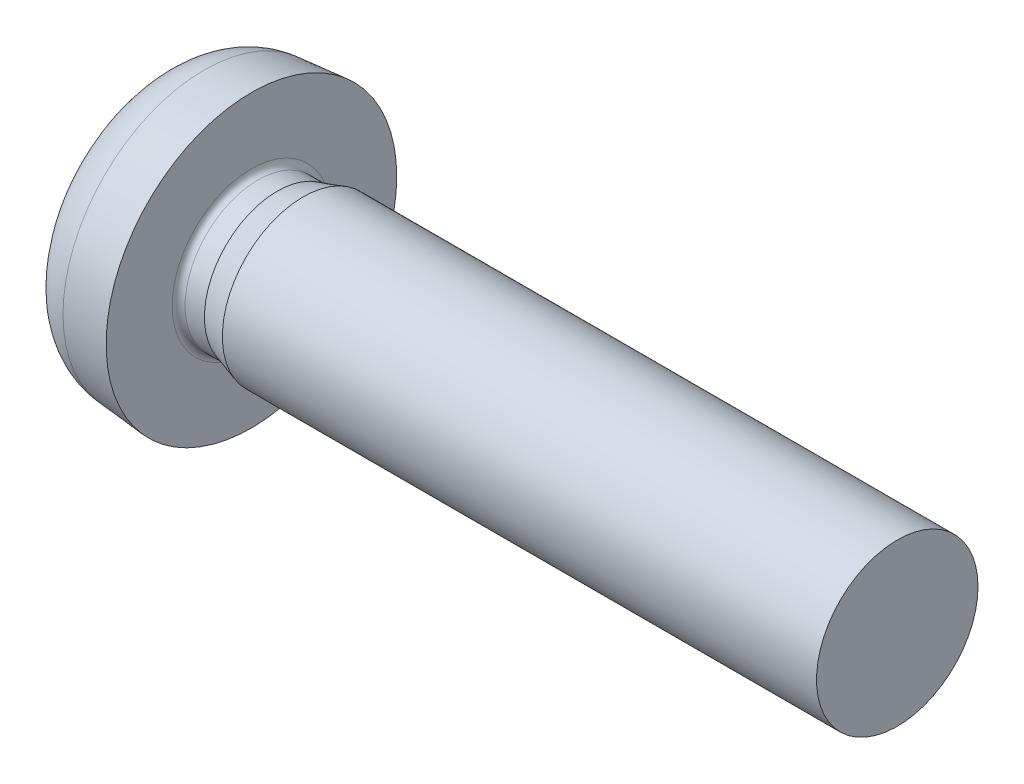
ISO-10303-21;
HEADER;
FILE_DESCRIPTION(('STEP AP214'),'2;1');
FILE_NAME('part.step','',(''),(''),'','','');
FILE_SCHEMA(('AUTOMOTIVE_DESIGN { 1 0 10303 214 1 1 1 1 }'));
ENDSEC;
DATA;
#1=APPLICATION_CONTEXT('core data for automotive mechanical design processes');
#2=APPLICATION_PROTOCOL_DEFINITION('international standard','automotive_design',2000,#1);
#3=PRODUCT_CONTEXT('',#1,'mechanical');
#4=PRODUCT('Part','Part','',(#3));
#5=PRODUCT_RELATED_PRODUCT_CATEGORY('part','',(#4));
#6=PRODUCT_DEFINITION_FORMATION('','',#4);
#7=PRODUCT_DEFINITION_CONTEXT('part definition',#1,'design');
#8=PRODUCT_DEFINITION('design','',#6,#7);
#9=PRODUCT_DEFINITION_SHAPE('','',#8);
#10=(LENGTH_UNIT() NAMED_UNIT(*) SI_UNIT(.MILLI.,.METRE.));
#11=(NAMED_UNIT(*) PLANE_ANGLE_UNIT() SI_UNIT($,.RADIAN.));
#12=(NAMED_UNIT(*) SI_UNIT($,.STERADIAN.) SOLID_ANGLE_UNIT());
#13=UNCERTAINTY_MEASURE_WITH_UNIT(LENGTH_MEASURE(1.E-05),#10,'distance_accuracy_value','');
#14=(GEOMETRIC_REPRESENTATION_CONTEXT(3) GLOBAL_UNCERTAINTY_ASSIGNED_CONTEXT((#13)) GLOBAL_UNIT_ASSIGNED_CONTEXT((#10,
#11,#12)) REPRESENTATION_CONTEXT('',''));
#15=CARTESIAN_POINT('',(0.,0.,0.));
#16=DIRECTION('',(0.,0.,1.));
#17=DIRECTION('',(1.,0.,0.));
#18=AXIS2_PLACEMENT_3D('',#15,#16,#17);
#19=CARTESIAN_POINT('',(8.70000000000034,0.,0.));
#20=DIRECTION('',(1.,0.,0.));
#21=DIRECTION('',(0.,1.,0.));
#22=AXIS2_PLACEMENT_3D('',#19,#20,#21);
#23=SPHERICAL_SURFACE('',#22,12.0000000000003);
#24=CARTESIAN_POINT('',(8.70000000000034,0.,-0.600000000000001));
#25=DIRECTION('',(0.,0.,1.));
#26=DIRECTION('',(1.,0.,0.));
#27=AXIS2_PLACEMENT_3D('',#24,#25,#26);
#28=CIRCLE('',#27,11.9849906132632);
#29=CARTESIAN_POINT('',(-3.19075270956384,1.5,-0.600000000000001));
#30=VERTEX_POINT('',#29);
#31=CARTESIAN_POINT('',(-3.03190095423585,2.45,-0.600000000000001));
#32=VERTEX_POINT('',#31);
#33=EDGE_CURVE('E223',#30,#32,#28,.F.);
#34=ORIENTED_EDGE('',*,*,#33,.T.);
#35=CARTESIAN_POINT('',(8.70000000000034,2.45,0.));
#36=DIRECTION('',(0.,-1.,0.));
#37=DIRECTION('',(0.,0.,-1.));
#38=AXIS2_PLACEMENT_3D('',#35,#36,#37);
#39=CIRCLE('',#38,11.7472337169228);
#40=CARTESIAN_POINT('',(-3.03190095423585,2.45,0.600000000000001));
#41=VERTEX_POINT('',#40);
#42=EDGE_CURVE('E360',#32,#41,#39,.F.);
#43=ORIENTED_EDGE('',*,*,#42,.T.);
#44=CARTESIAN_POINT('',(8.70000000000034,0.,0.600000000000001));
#45=DIRECTION('',(0.,0.,-1.));
#46=DIRECTION('',(-1.,0.,0.));
#47=AXIS2_PLACEMENT_3D('',#44,#45,#46);
#48=CIRCLE('',#47,11.9849906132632);
#49=CARTESIAN_POINT('',(-3.19075270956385,1.5,0.600000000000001));
#50=VERTEX_POINT('',#49);
#51=EDGE_CURVE('E185',#41,#50,#48,.F.);
#52=ORIENTED_EDGE('',*,*,#51,.T.);
#53=CARTESIAN_POINT('',(-3.19072747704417,0.600000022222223,1.5002));
#54=CARTESIAN_POINT('',(-3.19704855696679,0.599944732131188,1.45014663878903));
#55=CARTESIAN_POINT('',(-3.2028355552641,0.604151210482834,1.40002617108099));
#56=CARTESIAN_POINT('',(-3.21319825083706,0.620839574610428,1.30107200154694));
#57=CARTESIAN_POINT('',(-3.21777437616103,0.633318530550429,1.25223785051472));
#58=CARTESIAN_POINT('',(-3.22558007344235,0.666317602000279,1.15720078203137));
#59=CARTESIAN_POINT('',(-3.22880853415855,0.686844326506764,1.11100006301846));
#60=CARTESIAN_POINT('',(-3.2338172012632,0.735367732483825,1.02263672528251));
#61=CARTESIAN_POINT('',(-3.23559790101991,0.763361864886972,0.980472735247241));
#62=CARTESIAN_POINT('',(-3.23764946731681,0.825769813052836,0.901738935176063));
#63=CARTESIAN_POINT('',(-3.23793296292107,0.860127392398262,0.86512487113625));
#64=CARTESIAN_POINT('',(-3.23701554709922,0.934440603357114,0.798112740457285));
#65=CARTESIAN_POINT('',(-3.23581442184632,0.974397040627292,0.767715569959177));
#66=CARTESIAN_POINT('',(-3.23197125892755,1.05858769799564,0.714100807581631));
#67=CARTESIAN_POINT('',(-3.22933461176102,1.10280540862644,0.690856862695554));
#68=CARTESIAN_POINT('',(-3.22270116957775,1.19438163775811,0.652020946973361));
#69=CARTESIAN_POINT('',(-3.21870483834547,1.24173908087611,0.636426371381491));
#70=CARTESIAN_POINT('',(-3.21079050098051,1.32445339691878,0.616573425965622));
#71=CARTESIAN_POINT('',(-3.20717502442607,1.3593821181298,0.61035062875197));
#72=CARTESIAN_POINT('',(-3.19936940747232,1.42961484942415,0.602059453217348));
#73=CARTESIAN_POINT('',(-3.19518009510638,1.46491825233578,0.599985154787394));
#74=CARTESIAN_POINT('',(-3.19072747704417,1.5002,0.600000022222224));
#75=B_SPLINE_CURVE_WITH_KNOTS('',3,(#53,#54,#55,#56,#57,#58,#59,#60,#61,#62,#63,#64,#65,#66,#67,
#68,#69,#70,#71,#72,#73,#74),.UNSPECIFIED.,.F.,.F.,(4,2,2,2,2,2,2,2,2,2,4),(0.,
0.151172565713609,0.302291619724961,0.45353503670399,0.604726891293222,0.754641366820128,
0.904577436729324,1.05395432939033,1.20328032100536,1.3100314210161,1.41663007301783),.UNSPECIFIED.);
#76=CARTESIAN_POINT('',(-3.19075270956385,0.6,1.5));
#77=VERTEX_POINT('',#76);
#78=EDGE_CURVE('E178',#77,#50,#75,.T.);
#79=ORIENTED_EDGE('',*,*,#78,.F.);
#80=CARTESIAN_POINT('',(8.70000000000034,0.6,0.));
#81=DIRECTION('',(0.,-1.,0.));
#82=DIRECTION('',(0.,0.,-1.));
#83=AXIS2_PLACEMENT_3D('',#80,#81,#82);
#84=CIRCLE('',#83,11.9849906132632);
#85=CARTESIAN_POINT('',(-3.03190095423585,0.6,2.45));
#86=VERTEX_POINT('',#85);
#87=EDGE_CURVE('E175',#77,#86,#84,.F.);
#88=ORIENTED_EDGE('',*,*,#87,.T.);
#89=CARTESIAN_POINT('',(8.70000000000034,0.,2.45));
#90=DIRECTION('',(0.,0.,-1.));
#91=DIRECTION('',(-1.,0.,0.));
#92=AXIS2_PLACEMENT_3D('',#89,#90,#91);
#93=CIRCLE('',#92,11.7472337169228);
#94=CARTESIAN_POINT('',(-3.03190095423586,-0.6,2.45));
#95=VERTEX_POINT('',#94);
#96=EDGE_CURVE('E10',#86,#95,#93,.F.);
#97=ORIENTED_EDGE('',*,*,#96,.T.);
#98=CARTESIAN_POINT('',(8.70000000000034,-0.6,0.));
#99=DIRECTION('',(0.,1.,0.));
#100=DIRECTION('',(0.,0.,1.));
#101=AXIS2_PLACEMENT_3D('',#98,#99,#100);
#102=CIRCLE('',#101,11.9849906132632);
#103=CARTESIAN_POINT('',(-3.19075270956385,-0.6,1.5));
#104=VERTEX_POINT('',#103);
#105=EDGE_CURVE('E24',#95,#104,#102,.F.);
#106=ORIENTED_EDGE('',*,*,#105,.T.);
#107=CARTESIAN_POINT('',(-3.19072747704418,-1.5002,0.600000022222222));
#108=CARTESIAN_POINT('',(-3.1970485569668,-1.45014663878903,0.599944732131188));
#109=CARTESIAN_POINT('',(-3.20283555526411,-1.40002617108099,0.604151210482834));
#110=CARTESIAN_POINT('',(-3.21319825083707,-1.30107200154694,0.620839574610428));
#111=CARTESIAN_POINT('',(-3.21777437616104,-1.25223785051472,0.633318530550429));
#112=CARTESIAN_POINT('',(-3.22558007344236,-1.15720078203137,0.666317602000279));
#113=CARTESIAN_POINT('',(-3.22880853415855,-1.11100006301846,0.686844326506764));
#114=CARTESIAN_POINT('',(-3.2338172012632,-1.02263672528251,0.735367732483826));
#115=CARTESIAN_POINT('',(-3.23559790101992,-0.980472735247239,0.763361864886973));
#116=CARTESIAN_POINT('',(-3.23764946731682,-0.901738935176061,0.825769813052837));
#117=CARTESIAN_POINT('',(-3.23793296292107,-0.865124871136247,0.860127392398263));
#118=CARTESIAN_POINT('',(-3.23701554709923,-0.798112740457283,0.934440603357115));
#119=CARTESIAN_POINT('',(-3.23581442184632,-0.767715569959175,0.974397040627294));
#120=CARTESIAN_POINT('',(-3.23197125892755,-0.714100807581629,1.05858769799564));
#121=CARTESIAN_POINT('',(-3.22933461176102,-0.690856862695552,1.10280540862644));
#122=CARTESIAN_POINT('',(-3.22270116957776,-0.652020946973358,1.19438163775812));
#123=CARTESIAN_POINT('',(-3.21870483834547,-0.636426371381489,1.24173908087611));
#124=CARTESIAN_POINT('',(-3.21079050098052,-0.616573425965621,1.32445339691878));
#125=CARTESIAN_POINT('',(-3.20717502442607,-0.610350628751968,1.3593821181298));
#126=CARTESIAN_POINT('',(-3.19936940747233,-0.602059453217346,1.42961484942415));
#127=CARTESIAN_POINT('',(-3.19518009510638,-0.599985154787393,1.46491825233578));
#128=CARTESIAN_POINT('',(-3.19072747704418,-0.600000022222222,1.5002));
#129=B_SPLINE_CURVE_WITH_KNOTS('',3,(#107,#108,#109,#110,#111,#112,#113,#114,#115,#116,#117,
#118,#119,#120,#121,#122,#123,#124,#125,#126,#127,#128),.UNSPECIFIED.,.F.,.F.,(4,2,2,2,2,2,2,2,
2,2,4),(0.,0.151172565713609,0.302291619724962,0.453535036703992,0.604726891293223,
0.75464136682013,0.904577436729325,1.05395432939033,1.20328032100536,1.31003142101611,
1.41663007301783),.UNSPECIFIED.);
#130=CARTESIAN_POINT('',(-3.19075270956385,-1.5,0.6));
#131=VERTEX_POINT('',#130);
#132=EDGE_CURVE('E267',#131,#104,#129,.T.);
#133=ORIENTED_EDGE('',*,*,#132,.F.);
#134=CARTESIAN_POINT('',(8.70000000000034,0.,0.6));
#135=DIRECTION('',(0.,0.,-1.));
#136=DIRECTION('',(0.,1.,0.));
#137=AXIS2_PLACEMENT_3D('',#134,#135,#136);
#138=CIRCLE('',#137,11.9849906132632);
#139=CARTESIAN_POINT('',(-3.03190095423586,-2.45,0.6));
#140=VERTEX_POINT('',#139);
#141=EDGE_CURVE('E273',#131,#140,#138,.F.);
#142=ORIENTED_EDGE('',*,*,#141,.T.);
#143=CARTESIAN_POINT('',(8.70000000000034,-2.45,0.));
#144=DIRECTION('',(0.,1.,0.));
#145=DIRECTION('',(0.,0.,1.));
#146=AXIS2_PLACEMENT_3D('',#143,#144,#145);
#147=CIRCLE('',#146,11.7472337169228);
#148=CARTESIAN_POINT('',(-3.03190095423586,-2.45,-0.600000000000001));
#149=VERTEX_POINT('',#148);
#150=EDGE_CURVE('E379',#140,#149,#147,.F.);
#151=ORIENTED_EDGE('',*,*,#150,.T.);
#152=CARTESIAN_POINT('',(8.70000000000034,0.,-0.600000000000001));
#153=DIRECTION('',(0.,0.,1.));
#154=DIRECTION('',(1.,0.,0.));
#155=AXIS2_PLACEMENT_3D('',#152,#153,#154);
#156=CIRCLE('',#155,11.9849906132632);
#157=CARTESIAN_POINT('',(-3.19075270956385,-1.5,-0.600000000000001));
#158=VERTEX_POINT('',#157);
#159=EDGE_CURVE('E239',#149,#158,#156,.F.);
#160=ORIENTED_EDGE('',*,*,#159,.T.);
#161=CARTESIAN_POINT('',(-3.19072747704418,-0.600000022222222,-1.5002));
#162=CARTESIAN_POINT('',(-3.19704855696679,-0.599944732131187,-1.45014663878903));
#163=CARTESIAN_POINT('',(-3.20283555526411,-0.604151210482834,-1.40002617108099));
#164=CARTESIAN_POINT('',(-3.21319825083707,-0.620839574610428,-1.30107200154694));
#165=CARTESIAN_POINT('',(-3.21777437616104,-0.633318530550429,-1.25223785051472));
#166=CARTESIAN_POINT('',(-3.22558007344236,-0.666317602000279,-1.15720078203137));
#167=CARTESIAN_POINT('',(-3.22880853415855,-0.686844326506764,-1.11100006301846));
#168=CARTESIAN_POINT('',(-3.2338172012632,-0.735367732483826,-1.02263672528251));
#169=CARTESIAN_POINT('',(-3.23559790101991,-0.763361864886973,-0.98047273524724));
#170=CARTESIAN_POINT('',(-3.23764946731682,-0.825769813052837,-0.901738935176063));
#171=CARTESIAN_POINT('',(-3.23793296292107,-0.860127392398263,-0.865124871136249));
#172=CARTESIAN_POINT('',(-3.23701554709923,-0.934440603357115,-0.798112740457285));
#173=CARTESIAN_POINT('',(-3.23581442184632,-0.974397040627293,-0.767715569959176));
#174=CARTESIAN_POINT('',(-3.23197125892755,-1.05858769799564,-0.714100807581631));
#175=CARTESIAN_POINT('',(-3.22933461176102,-1.10280540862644,-0.690856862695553));
#176=CARTESIAN_POINT('',(-3.22270116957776,-1.19438163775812,-0.65202094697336));
#177=CARTESIAN_POINT('',(-3.21870483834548,-1.24173908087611,-0.63642637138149));
#178=CARTESIAN_POINT('',(-3.21079050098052,-1.32445339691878,-0.616573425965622));
#179=CARTESIAN_POINT('',(-3.20717502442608,-1.3593821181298,-0.61035062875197));
#180=CARTESIAN_POINT('',(-3.19936940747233,-1.42961484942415,-0.602059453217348));
#181=CARTESIAN_POINT('',(-3.19518009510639,-1.46491825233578,-0.599985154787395));
#182=CARTESIAN_POINT('',(-3.19072747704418,-1.5002,-0.600000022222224));
#183=B_SPLINE_CURVE_WITH_KNOTS('',3,(#161,#162,#163,#164,#165,#166,#167,#168,#169,#170,#171,
#172,#173,#174,#175,#176,#177,#178,#179,#180,#181,#182),.UNSPECIFIED.,.F.,.F.,(4,2,2,2,2,2,2,2,
2,2,4),(0.,0.151172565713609,0.302291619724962,0.453535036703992,0.604726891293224,
0.75464136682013,0.904577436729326,1.05395432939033,1.20328032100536,1.31003142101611,
1.41663007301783),.UNSPECIFIED.);
#184=CARTESIAN_POINT('',(-3.19075270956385,-0.6,-1.5));
#185=VERTEX_POINT('',#184);
#186=EDGE_CURVE('E232',#185,#158,#183,.T.);
#187=ORIENTED_EDGE('',*,*,#186,.F.);
#188=CARTESIAN_POINT('',(8.70000000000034,-0.6,0.));
#189=DIRECTION('',(0.,1.,0.));
#190=DIRECTION('',(0.,0.,1.));
#191=AXIS2_PLACEMENT_3D('',#188,#189,#190);
#192=CIRCLE('',#191,11.9849906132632);
#193=CARTESIAN_POINT('',(-3.03190095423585,-0.6,-2.45));
#194=VERTEX_POINT('',#193);
#195=EDGE_CURVE('E229',#185,#194,#192,.F.);
#196=ORIENTED_EDGE('',*,*,#195,.T.);
#197=CARTESIAN_POINT('',(8.70000000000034,0.,-2.45));
#198=DIRECTION('',(0.,0.,1.));
#199=DIRECTION('',(1.,0.,0.));
#200=AXIS2_PLACEMENT_3D('',#197,#198,#199);
#201=CIRCLE('',#200,11.7472337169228);
#202=CARTESIAN_POINT('',(-3.03190095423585,0.6,-2.45));
#203=VERTEX_POINT('',#202);
#204=EDGE_CURVE('E226',#194,#203,#201,.F.);
#205=ORIENTED_EDGE('',*,*,#204,.T.);
#206=CARTESIAN_POINT('',(8.70000000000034,0.6,0.));
#207=DIRECTION('',(0.,-1.,0.));
#208=DIRECTION('',(0.,0.,-1.));
#209=AXIS2_PLACEMENT_3D('',#206,#207,#208);
#210=CIRCLE('',#209,11.9849906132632);
#211=CARTESIAN_POINT('',(-3.19075270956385,0.6,-1.5));
#212=VERTEX_POINT('',#211);
#213=EDGE_CURVE('E222',#203,#212,#210,.F.);
#214=ORIENTED_EDGE('',*,*,#213,.T.);
#215=CARTESIAN_POINT('',(-3.19072747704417,1.5002,-0.600000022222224));
#216=CARTESIAN_POINT('',(-3.19704855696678,1.45014663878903,-0.599944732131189));
#217=CARTESIAN_POINT('',(-3.2028355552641,1.40002617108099,-0.604151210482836));
#218=CARTESIAN_POINT('',(-3.21319825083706,1.30107200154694,-0.620839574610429));
#219=CARTESIAN_POINT('',(-3.21777437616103,1.25223785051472,-0.633318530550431));
#220=CARTESIAN_POINT('',(-3.22558007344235,1.15720078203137,-0.66631760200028));
#221=CARTESIAN_POINT('',(-3.22880853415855,1.11100006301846,-0.686844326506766));
#222=CARTESIAN_POINT('',(-3.23381720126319,1.02263672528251,-0.735367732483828));
#223=CARTESIAN_POINT('',(-3.23559790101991,0.980472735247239,-0.763361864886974));
#224=CARTESIAN_POINT('',(-3.23764946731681,0.901738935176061,-0.825769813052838));
#225=CARTESIAN_POINT('',(-3.23793296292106,0.865124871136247,-0.860127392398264));
#226=CARTESIAN_POINT('',(-3.23701554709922,0.798112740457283,-0.934440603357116));
#227=CARTESIAN_POINT('',(-3.23581442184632,0.767715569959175,-0.974397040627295));
#228=CARTESIAN_POINT('',(-3.23197125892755,0.714100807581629,-1.05858769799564));
#229=CARTESIAN_POINT('',(-3.22933461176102,0.690856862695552,-1.10280540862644));
#230=CARTESIAN_POINT('',(-3.22270116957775,0.652020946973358,-1.19438163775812));
#231=CARTESIAN_POINT('',(-3.21870483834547,0.636426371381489,-1.24173908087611));
#232=CARTESIAN_POINT('',(-3.21079050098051,0.616573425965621,-1.32445339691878));
#233=CARTESIAN_POINT('',(-3.20717502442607,0.610350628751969,-1.35938211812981));
#234=CARTESIAN_POINT('',(-3.19936940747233,0.602059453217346,-1.42961484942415));
#235=CARTESIAN_POINT('',(-3.19518009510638,0.599985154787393,-1.46491825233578));
#236=CARTESIAN_POINT('',(-3.19072747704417,0.600000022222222,-1.5002));
#237=B_SPLINE_CURVE_WITH_KNOTS('',3,(#215,#216,#217,#218,#219,#220,#221,#222,#223,#224,#225,
#226,#227,#228,#229,#230,#231,#232,#233,#234,#235,#236),.UNSPECIFIED.,.F.,.F.,(4,2,2,2,2,2,2,2,
2,2,4),(0.,0.151172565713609,0.302291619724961,0.453535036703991,0.604726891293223,
0.75464136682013,0.904577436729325,1.05395432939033,1.20328032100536,1.3100314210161,
1.41663007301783),.UNSPECIFIED.);
#238=EDGE_CURVE('E215',#30,#212,#237,.T.);
#239=ORIENTED_EDGE('',*,*,#238,.F.);
#240=EDGE_LOOP('',(#34,#43,#52,#79,#88,#97,#106,#133,#142,#151,#160,#187,#196,#205,#214,#239));
#241=FACE_BOUND('',#240,.T.);
#242=CARTESIAN_POINT('',(-2.86390297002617,0.,0.));
#243=DIRECTION('',(1.,0.,0.));
#244=DIRECTION('',(0.,0.,-1.));
#245=AXIS2_PLACEMENT_3D('',#242,#243,#244);
#246=CIRCLE('',#245,3.2056431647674);
#247=CARTESIAN_POINT('',(-2.86390297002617,0.,-3.2056431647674));
#248=VERTEX_POINT('',#247);
#249=EDGE_CURVE('E172',#248,#248,#246,.T.);
#250=ORIENTED_EDGE('',*,*,#249,.F.);
#251=EDGE_LOOP('',(#250));
#252=FACE_BOUND('',#251,.T.);
#253=ADVANCED_FACE('F16',(#241,#252),#23,.T.);
#254=CARTESIAN_POINT('',(-1.32204927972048,0.,0.));
#255=DIRECTION('',(1.,0.,0.));
#256=DIRECTION('',(0.,0.,-1.));
#257=AXIS2_PLACEMENT_3D('',#254,#255,#256);
#258=TOROIDAL_SURFACE('',#257,2.77822393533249,1.6);
#259=ORIENTED_EDGE('',*,*,#249,.T.);
#260=EDGE_LOOP('',(#259));
#261=FACE_BOUND('',#260,.T.);
#262=CARTESIAN_POINT('',(-1.46149846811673,0.,0.));
#263=DIRECTION('',(1.,0.,0.));
#264=DIRECTION('',(0.,0.,-1.));
#265=AXIS2_PLACEMENT_3D('',#262,#263,#264);
#266=CIRCLE('',#265,4.37213545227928);
#267=CARTESIAN_POINT('',(-1.46149846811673,0.,-4.37213545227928));
#268=VERTEX_POINT('',#267);
#269=EDGE_CURVE('E169',#268,#268,#266,.T.);
#270=ORIENTED_EDGE('',*,*,#269,.F.);
#271=EDGE_LOOP('',(#270));
#272=FACE_BOUND('',#271,.T.);
#273=ADVANCED_FACE('F386',(#261,#272),#258,.T.);
#274=CARTESIAN_POINT('',(-1.46149846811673,0.,0.));
#275=DIRECTION('',(1.,0.,0.));
#276=DIRECTION('',(0.,0.,-1.));
#277=AXIS2_PLACEMENT_3D('',#274,#275,#276);
#278=CONICAL_SURFACE('',#277,4.37213545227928,0.0872664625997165);
#279=CARTESIAN_POINT('',(0.,0.,0.));
#280=DIRECTION('',(1.,0.,0.));
#281=DIRECTION('',(0.,0.,-1.));
#282=AXIS2_PLACEMENT_3D('',#279,#280,#281);
#283=CIRCLE('',#282,4.5);
#284=CARTESIAN_POINT('',(0.,0.,-4.5));
#285=VERTEX_POINT('',#284);
#286=EDGE_CURVE('E166',#285,#285,#283,.T.);
#287=ORIENTED_EDGE('',*,*,#286,.F.);
#288=EDGE_LOOP('',(#287));
#289=FACE_BOUND('',#288,.T.);
#290=ORIENTED_EDGE('',*,*,#269,.T.);
#291=EDGE_LOOP('',(#290));
#292=FACE_BOUND('',#291,.T.);
#293=ADVANCED_FACE('F390',(#289,#292),#278,.T.);
#294=CARTESIAN_POINT('',(0.,4.5,0.));
#295=DIRECTION('',(-1.,0.,0.));
#296=DIRECTION('',(0.,0.,1.));
#297=AXIS2_PLACEMENT_3D('',#294,#295,#296);
#298=PLANE('',#297);
#299=CARTESIAN_POINT('',(0.,0.,0.));
#300=DIRECTION('',(1.,0.,0.));
#301=DIRECTION('',(0.,0.,-1.));
#302=AXIS2_PLACEMENT_3D('',#299,#300,#301);
#303=CIRCLE('',#302,2.45474999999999);
#304=CARTESIAN_POINT('',(0.,0.,-2.45474999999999));
#305=VERTEX_POINT('',#304);
#306=EDGE_CURVE('E163',#305,#305,#303,.T.);
#307=ORIENTED_EDGE('',*,*,#306,.F.);
#308=EDGE_LOOP('',(#307));
#309=FACE_BOUND('',#308,.T.);
#310=ORIENTED_EDGE('',*,*,#286,.T.);
#311=EDGE_LOOP('',(#310));
#312=FACE_BOUND('',#311,.T.);
#313=ADVANCED_FACE('F395',(#309,#312),#298,.F.);
#314=CARTESIAN_POINT('',(0.2,0.,0.));
#315=DIRECTION('',(1.,0.,0.));
#316=DIRECTION('',(0.,0.,-1.));
#317=AXIS2_PLACEMENT_3D('',#314,#315,#316);
#318=TOROIDAL_SURFACE('',#317,2.45474999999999,0.2);
#319=CARTESIAN_POINT('',(0.200000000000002,0.,0.));
#320=DIRECTION('',(1.,0.,0.));
#321=DIRECTION('',(0.,0.,-1.));
#322=AXIS2_PLACEMENT_3D('',#319,#320,#321);
#323=CIRCLE('',#322,2.25474999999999);
#324=CARTESIAN_POINT('',(0.200000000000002,0.,-2.25474999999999));
#325=VERTEX_POINT('',#324);
#326=EDGE_CURVE('E160',#325,#325,#323,.T.);
#327=ORIENTED_EDGE('',*,*,#326,.F.);
#328=EDGE_LOOP('',(#327));
#329=FACE_BOUND('',#328,.T.);
#330=ORIENTED_EDGE('',*,*,#306,.T.);
#331=EDGE_LOOP('',(#330));
#332=FACE_BOUND('',#331,.T.);
#333=ADVANCED_FACE('F402',(#329,#332),#318,.F.);
#334=CARTESIAN_POINT('',(20.,0.,0.));
#335=DIRECTION('',(1.,0.,0.));
#336=DIRECTION('',(0.,0.,-1.));
#337=AXIS2_PLACEMENT_3D('',#334,#335,#336);
#338=CYLINDRICAL_SURFACE('',#337,2.25474999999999);
#339=CARTESIAN_POINT('',(0.799999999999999,0.,0.));
#340=DIRECTION('',(1.,0.,0.));
#341=DIRECTION('',(0.,0.,-1.));
#342=AXIS2_PLACEMENT_3D('',#339,#340,#341);
#343=CIRCLE('',#342,2.25474999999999);
#344=CARTESIAN_POINT('',(0.799999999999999,0.,-2.25474999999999));
#345=VERTEX_POINT('',#344);
#346=EDGE_CURVE('E157',#345,#345,#343,.T.);
#347=ORIENTED_EDGE('',*,*,#346,.F.);
#348=EDGE_LOOP('',(#347));
#349=FACE_BOUND('',#348,.T.);
#350=ORIENTED_EDGE('',*,*,#326,.T.);
#351=EDGE_LOOP('',(#350));
#352=FACE_BOUND('',#351,.T.);
#353=ADVANCED_FACE('F406',(#349,#352),#338,.T.);
#354=CARTESIAN_POINT('',(0.799999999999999,0.,0.));
#355=DIRECTION('',(1.,0.,0.));
#356=DIRECTION('',(0.,0.,-1.));
#357=AXIS2_PLACEMENT_3D('',#354,#355,#356);
#358=CONICAL_SURFACE('',#357,2.25474999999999,0.29746650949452);
#359=CARTESIAN_POINT('',(1.6,0.,0.));
#360=DIRECTION('',(1.,0.,0.));
#361=DIRECTION('',(0.,0.,-1.));
#362=AXIS2_PLACEMENT_3D('',#359,#360,#361);
#363=CIRCLE('',#362,2.5);
#364=CARTESIAN_POINT('',(1.6,0.,-2.5));
#365=VERTEX_POINT('',#364);
#366=EDGE_CURVE('E149',#365,#365,#363,.T.);
#367=ORIENTED_EDGE('',*,*,#366,.F.);
#368=EDGE_LOOP('',(#367));
#369=FACE_BOUND('',#368,.T.);
#370=ORIENTED_EDGE('',*,*,#346,.T.);
#371=EDGE_LOOP('',(#370));
#372=FACE_BOUND('',#371,.T.);
#373=ADVANCED_FACE('F410',(#369,#372),#358,.T.);
#374=CARTESIAN_POINT('',(20.,0.,0.));
#375=DIRECTION('',(1.,0.,0.));
#376=DIRECTION('',(0.,0.,-1.));
#377=AXIS2_PLACEMENT_3D('',#374,#375,#376);
#378=CYLINDRICAL_SURFACE('',#377,2.5);
#379=CARTESIAN_POINT('',(20.,0.,0.));
#380=DIRECTION('',(1.,0.,0.));
#381=DIRECTION('',(0.,0.,-1.));
#382=AXIS2_PLACEMENT_3D('',#379,#380,#381);
#383=CIRCLE('',#382,2.5);
#384=CARTESIAN_POINT('',(20.,0.,-2.5));
#385=VERTEX_POINT('',#384);
#386=EDGE_CURVE('E145',#385,#385,#383,.T.);
#387=ORIENTED_EDGE('',*,*,#386,.F.);
#388=EDGE_LOOP('',(#387));
#389=FACE_BOUND('',#388,.T.);
#390=ORIENTED_EDGE('',*,*,#366,.T.);
#391=EDGE_LOOP('',(#390));
#392=FACE_BOUND('',#391,.T.);
#393=ADVANCED_FACE('F414',(#389,#392),#378,.T.);
#394=CARTESIAN_POINT('',(20.,2.5,0.));
#395=DIRECTION('',(-1.,0.,0.));
#396=DIRECTION('',(0.,0.,1.));
#397=AXIS2_PLACEMENT_3D('',#394,#395,#396);
#398=PLANE('',#397);
#399=ORIENTED_EDGE('',*,*,#386,.T.);
#400=EDGE_LOOP('',(#399));
#401=FACE_BOUND('',#400,.T.);
#402=ADVANCED_FACE('F418',(#401),#398,.F.);
#403=CARTESIAN_POINT('',(-1.65,0.6,2.45));
#404=DIRECTION('',(0.,0.,-1.));
#405=DIRECTION('',(-1.,0.,0.));
#406=AXIS2_PLACEMENT_3D('',#403,#404,#405);
#407=PLANE('',#406);
#408=DIRECTION('',(-1.,0.,0.));
#409=VECTOR('',#408,1.);
#410=CARTESIAN_POINT('',(-1.65,0.6,2.45));
#411=LINE('',#410,#409);
#412=CARTESIAN_POINT('',(-1.65,0.6,2.45));
#413=VERTEX_POINT('',#412);
#414=EDGE_CURVE('E31',#413,#86,#411,.T.);
#415=ORIENTED_EDGE('',*,*,#414,.F.);
#416=DIRECTION('',(0.,-1.,0.));
#417=VECTOR('',#416,1.);
#418=CARTESIAN_POINT('',(-1.65,0.6,2.45));
#419=LINE('',#418,#417);
#420=CARTESIAN_POINT('',(-1.65,-0.6,2.45));
#421=VERTEX_POINT('',#420);
#422=EDGE_CURVE('E134',#413,#421,#419,.T.);
#423=ORIENTED_EDGE('',*,*,#422,.T.);
#424=DIRECTION('',(-1.,0.,0.));
#425=VECTOR('',#424,1.);
#426=CARTESIAN_POINT('',(-1.65,-0.6,2.45));
#427=LINE('',#426,#425);
#428=EDGE_CURVE('E142',#421,#95,#427,.T.);
#429=ORIENTED_EDGE('',*,*,#428,.T.);
#430=ORIENTED_EDGE('',*,*,#96,.F.);
#431=EDGE_LOOP('',(#415,#423,#429,#430));
#432=FACE_BOUND('',#431,.T.);
#433=ADVANCED_FACE('F141',(#432),#407,.T.);
#434=CARTESIAN_POINT('',(-1.65,-0.6,2.45));
#435=DIRECTION('',(0.,1.,0.));
#436=DIRECTION('',(0.,0.,1.));
#437=AXIS2_PLACEMENT_3D('',#434,#435,#436);
#438=PLANE('',#437);
#439=ORIENTED_EDGE('',*,*,#428,.F.);
#440=DIRECTION('',(0.,0.,-1.));
#441=VECTOR('',#440,1.);
#442=CARTESIAN_POINT('',(-1.65,-0.6,2.45));
#443=LINE('',#442,#441);
#444=CARTESIAN_POINT('',(-1.65,-0.6,1.5));
#445=VERTEX_POINT('',#444);
#446=EDGE_CURVE('E130',#421,#445,#443,.T.);
#447=ORIENTED_EDGE('',*,*,#446,.T.);
#448=DIRECTION('',(-1.,0.,0.));
#449=VECTOR('',#448,1.);
#450=CARTESIAN_POINT('',(-1.65,-0.6,1.5));
#451=LINE('',#450,#449);
#452=EDGE_CURVE('E146',#445,#104,#451,.T.);
#453=ORIENTED_EDGE('',*,*,#452,.T.);
#454=ORIENTED_EDGE('',*,*,#105,.F.);
#455=EDGE_LOOP('',(#439,#447,#453,#454));
#456=FACE_BOUND('',#455,.T.);
#457=ADVANCED_FACE('F144',(#456),#438,.T.);
#458=CARTESIAN_POINT('',(-1.65,-1.5,1.5));
#459=DIRECTION('',(-1.,0.,0.));
#460=DIRECTION('',(0.,0.,1.));
#461=AXIS2_PLACEMENT_3D('',#458,#459,#460);
#462=CYLINDRICAL_SURFACE('',#461,0.9);
#463=ORIENTED_EDGE('',*,*,#132,.T.);
#464=ORIENTED_EDGE('',*,*,#452,.F.);
#465=CARTESIAN_POINT('',(-1.65,-1.5,1.5));
#466=DIRECTION('',(1.,0.,0.));
#467=DIRECTION('',(0.,0.,-1.));
#468=AXIS2_PLACEMENT_3D('',#465,#466,#467);
#469=CIRCLE('',#468,0.9);
#470=CARTESIAN_POINT('',(-1.65,-1.5,0.6));
#471=VERTEX_POINT('',#470);
#472=EDGE_CURVE('E137',#471,#445,#469,.T.);
#473=ORIENTED_EDGE('',*,*,#472,.F.);
#474=DIRECTION('',(-1.,0.,0.));
#475=VECTOR('',#474,1.);
#476=CARTESIAN_POINT('',(-1.65,-1.5,0.6));
#477=LINE('',#476,#475);
#478=EDGE_CURVE('E151',#471,#131,#477,.T.);
#479=ORIENTED_EDGE('',*,*,#478,.T.);
#480=EDGE_LOOP('',(#463,#464,#473,#479));
#481=FACE_BOUND('',#480,.T.);
#482=ADVANCED_FACE('F259',(#481),#462,.T.);
#483=CARTESIAN_POINT('',(-1.65,-1.5,0.6));
#484=DIRECTION('',(0.,0.,-1.));
#485=DIRECTION('',(0.,1.,0.));
#486=AXIS2_PLACEMENT_3D('',#483,#484,#485);
#487=PLANE('',#486);
#488=ORIENTED_EDGE('',*,*,#478,.F.);
#489=DIRECTION('',(0.,-1.,0.));
#490=VECTOR('',#489,1.);
#491=CARTESIAN_POINT('',(-1.65,-1.5,0.6));
#492=LINE('',#491,#490);
#493=CARTESIAN_POINT('',(-1.65,-2.45,0.6));
#494=VERTEX_POINT('',#493);
#495=EDGE_CURVE('E325',#471,#494,#492,.T.);
#496=ORIENTED_EDGE('',*,*,#495,.T.);
#497=DIRECTION('',(-1.,0.,0.));
#498=VECTOR('',#497,1.);
#499=CARTESIAN_POINT('',(-1.65,-2.45,0.6));
#500=LINE('',#499,#498);
#501=EDGE_CURVE('E322',#494,#140,#500,.T.);
#502=ORIENTED_EDGE('',*,*,#501,.T.);
#503=ORIENTED_EDGE('',*,*,#141,.F.);
#504=EDGE_LOOP('',(#488,#496,#502,#503));
#505=FACE_BOUND('',#504,.T.);
#506=ADVANCED_FACE('F255',(#505),#487,.T.);
#507=CARTESIAN_POINT('',(-1.65,-2.45,0.6));
#508=DIRECTION('',(0.,1.,0.));
#509=DIRECTION('',(0.,0.,1.));
#510=AXIS2_PLACEMENT_3D('',#507,#508,#509);
#511=PLANE('',#510);
#512=ORIENTED_EDGE('',*,*,#501,.F.);
#513=DIRECTION('',(0.,0.,-1.));
#514=VECTOR('',#513,1.);
#515=CARTESIAN_POINT('',(-1.65,-2.45,0.6));
#516=LINE('',#515,#514);
#517=CARTESIAN_POINT('',(-1.65,-2.45,-0.600000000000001));
#518=VERTEX_POINT('',#517);
#519=EDGE_CURVE('E329',#494,#518,#516,.T.);
#520=ORIENTED_EDGE('',*,*,#519,.T.);
#521=DIRECTION('',(-1.,0.,0.));
#522=VECTOR('',#521,1.);
#523=CARTESIAN_POINT('',(-1.65,-2.45,-0.600000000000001));
#524=LINE('',#523,#522);
#525=EDGE_CURVE('E319',#518,#149,#524,.T.);
#526=ORIENTED_EDGE('',*,*,#525,.T.);
#527=ORIENTED_EDGE('',*,*,#150,.F.);
#528=EDGE_LOOP('',(#512,#520,#526,#527));
#529=FACE_BOUND('',#528,.T.);
#530=ADVANCED_FACE('F251',(#529),#511,.T.);
#531=CARTESIAN_POINT('',(-1.65,-2.45,-0.600000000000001));
#532=DIRECTION('',(0.,0.,1.));
#533=DIRECTION('',(1.,0.,0.));
#534=AXIS2_PLACEMENT_3D('',#531,#532,#533);
#535=PLANE('',#534);
#536=ORIENTED_EDGE('',*,*,#525,.F.);
#537=DIRECTION('',(0.,1.,0.));
#538=VECTOR('',#537,1.);
#539=CARTESIAN_POINT('',(-1.65,-2.45,-0.600000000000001));
#540=LINE('',#539,#538);
#541=CARTESIAN_POINT('',(-1.65,-1.5,-0.600000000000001));
#542=VERTEX_POINT('',#541);
#543=EDGE_CURVE('E331',#518,#542,#540,.T.);
#544=ORIENTED_EDGE('',*,*,#543,.T.);
#545=DIRECTION('',(-1.,0.,0.));
#546=VECTOR('',#545,1.);
#547=CARTESIAN_POINT('',(-1.65,-1.5,-0.600000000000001));
#548=LINE('',#547,#546);
#549=EDGE_CURVE('E316',#542,#158,#548,.T.);
#550=ORIENTED_EDGE('',*,*,#549,.T.);
#551=ORIENTED_EDGE('',*,*,#159,.F.);
#552=EDGE_LOOP('',(#536,#544,#550,#551));
#553=FACE_BOUND('',#552,.T.);
#554=ADVANCED_FACE('F247',(#553),#535,.T.);
#555=CARTESIAN_POINT('',(-1.65,-1.5,-1.5));
#556=DIRECTION('',(-1.,0.,0.));
#557=DIRECTION('',(0.,0.,1.));
#558=AXIS2_PLACEMENT_3D('',#555,#556,#557);
#559=CYLINDRICAL_SURFACE('',#558,0.9);
#560=ORIENTED_EDGE('',*,*,#186,.T.);
#561=ORIENTED_EDGE('',*,*,#549,.F.);
#562=CARTESIAN_POINT('',(-1.65,-1.5,-1.5));
#563=DIRECTION('',(1.,0.,0.));
#564=DIRECTION('',(0.,0.,-1.));
#565=AXIS2_PLACEMENT_3D('',#562,#563,#564);
#566=CIRCLE('',#565,0.9);
#567=CARTESIAN_POINT('',(-1.65,-0.6,-1.5));
#568=VERTEX_POINT('',#567);
#569=EDGE_CURVE('E336',#568,#542,#566,.T.);
#570=ORIENTED_EDGE('',*,*,#569,.F.);
#571=DIRECTION('',(-1.,0.,0.));
#572=VECTOR('',#571,1.);
#573=CARTESIAN_POINT('',(-1.65,-0.6,-1.5));
#574=LINE('',#573,#572);
#575=EDGE_CURVE('E313',#568,#185,#574,.T.);
#576=ORIENTED_EDGE('',*,*,#575,.T.);
#577=EDGE_LOOP('',(#560,#561,#570,#576));
#578=FACE_BOUND('',#577,.T.);
#579=ADVANCED_FACE('F241',(#578),#559,.T.);
#580=CARTESIAN_POINT('',(-1.65,-0.6,-1.5));
#581=DIRECTION('',(0.,1.,0.));
#582=DIRECTION('',(0.,0.,1.));
#583=AXIS2_PLACEMENT_3D('',#580,#581,#582);
#584=PLANE('',#583);
#585=ORIENTED_EDGE('',*,*,#575,.F.);
#586=DIRECTION('',(0.,0.,-1.));
#587=VECTOR('',#586,1.);
#588=CARTESIAN_POINT('',(-1.65,-0.6,-1.5));
#589=LINE('',#588,#587);
#590=CARTESIAN_POINT('',(-1.65,-0.6,-2.45));
#591=VERTEX_POINT('',#590);
#592=EDGE_CURVE('E339',#568,#591,#589,.T.);
#593=ORIENTED_EDGE('',*,*,#592,.T.);
#594=DIRECTION('',(-1.,0.,0.));
#595=VECTOR('',#594,1.);
#596=CARTESIAN_POINT('',(-1.65,-0.6,-2.45));
#597=LINE('',#596,#595);
#598=EDGE_CURVE('E310',#591,#194,#597,.T.);
#599=ORIENTED_EDGE('',*,*,#598,.T.);
#600=ORIENTED_EDGE('',*,*,#195,.F.);
#601=EDGE_LOOP('',(#585,#593,#599,#600));
#602=FACE_BOUND('',#601,.T.);
#603=ADVANCED_FACE('F246',(#602),#584,.T.);
#604=CARTESIAN_POINT('',(-1.65,-0.6,-2.45));
#605=DIRECTION('',(0.,0.,1.));
#606=DIRECTION('',(1.,0.,0.));
#607=AXIS2_PLACEMENT_3D('',#604,#605,#606);
#608=PLANE('',#607);
#609=ORIENTED_EDGE('',*,*,#598,.F.);
#610=DIRECTION('',(0.,1.,0.));
#611=VECTOR('',#610,1.);
#612=CARTESIAN_POINT('',(-1.65,-0.6,-2.45));
#613=LINE('',#612,#611);
#614=CARTESIAN_POINT('',(-1.65,0.6,-2.45));
#615=VERTEX_POINT('',#614);
#616=EDGE_CURVE('E341',#591,#615,#613,.T.);
#617=ORIENTED_EDGE('',*,*,#616,.T.);
#618=DIRECTION('',(-1.,0.,0.));
#619=VECTOR('',#618,1.);
#620=CARTESIAN_POINT('',(-1.65,0.6,-2.45));
#621=LINE('',#620,#619);
#622=EDGE_CURVE('E307',#615,#203,#621,.T.);
#623=ORIENTED_EDGE('',*,*,#622,.T.);
#624=ORIENTED_EDGE('',*,*,#204,.F.);
#625=EDGE_LOOP('',(#609,#617,#623,#624));
#626=FACE_BOUND('',#625,.T.);
#627=ADVANCED_FACE('F371',(#626),#608,.T.);
#628=CARTESIAN_POINT('',(-1.65,0.6,-2.45));
#629=DIRECTION('',(0.,-1.,0.));
#630=DIRECTION('',(0.,0.,-1.));
#631=AXIS2_PLACEMENT_3D('',#628,#629,#630);
#632=PLANE('',#631);
#633=ORIENTED_EDGE('',*,*,#622,.F.);
#634=DIRECTION('',(0.,0.,1.));
#635=VECTOR('',#634,1.);
#636=CARTESIAN_POINT('',(-1.65,0.6,-2.45));
#637=LINE('',#636,#635);
#638=CARTESIAN_POINT('',(-1.65,0.6,-1.5));
#639=VERTEX_POINT('',#638);
#640=EDGE_CURVE('E343',#615,#639,#637,.T.);
#641=ORIENTED_EDGE('',*,*,#640,.T.);
#642=DIRECTION('',(-1.,0.,0.));
#643=VECTOR('',#642,1.);
#644=CARTESIAN_POINT('',(-1.65,0.6,-1.5));
#645=LINE('',#644,#643);
#646=EDGE_CURVE('E304',#639,#212,#645,.T.);
#647=ORIENTED_EDGE('',*,*,#646,.T.);
#648=ORIENTED_EDGE('',*,*,#213,.F.);
#649=EDGE_LOOP('',(#633,#641,#647,#648));
#650=FACE_BOUND('',#649,.T.);
#651=ADVANCED_FACE('F211',(#650),#632,.T.);
#652=CARTESIAN_POINT('',(-1.65,1.5,-1.5));
#653=DIRECTION('',(-1.,0.,0.));
#654=DIRECTION('',(0.,0.,1.));
#655=AXIS2_PLACEMENT_3D('',#652,#653,#654);
#656=CYLINDRICAL_SURFACE('',#655,0.900000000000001);
#657=ORIENTED_EDGE('',*,*,#238,.T.);
#658=ORIENTED_EDGE('',*,*,#646,.F.);
#659=CARTESIAN_POINT('',(-1.65,1.5,-1.5));
#660=DIRECTION('',(1.,0.,0.));
#661=DIRECTION('',(0.,0.,-1.));
#662=AXIS2_PLACEMENT_3D('',#659,#660,#661);
#663=CIRCLE('',#662,0.900000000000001);
#664=CARTESIAN_POINT('',(-1.65,1.5,-0.600000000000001));
#665=VERTEX_POINT('',#664);
#666=EDGE_CURVE('E345',#665,#639,#663,.T.);
#667=ORIENTED_EDGE('',*,*,#666,.F.);
#668=DIRECTION('',(-1.,0.,0.));
#669=VECTOR('',#668,1.);
#670=CARTESIAN_POINT('',(-1.65,1.5,-0.600000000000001));
#671=LINE('',#670,#669);
#672=EDGE_CURVE('E301',#665,#30,#671,.T.);
#673=ORIENTED_EDGE('',*,*,#672,.T.);
#674=EDGE_LOOP('',(#657,#658,#667,#673));
#675=FACE_BOUND('',#674,.T.);
#676=ADVANCED_FACE('F206',(#675),#656,.T.);
#677=CARTESIAN_POINT('',(-1.65,1.5,-0.600000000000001));
#678=DIRECTION('',(0.,0.,1.));
#679=DIRECTION('',(1.,0.,0.));
#680=AXIS2_PLACEMENT_3D('',#677,#678,#679);
#681=PLANE('',#680);
#682=ORIENTED_EDGE('',*,*,#672,.F.);
#683=DIRECTION('',(0.,1.,0.));
#684=VECTOR('',#683,1.);
#685=CARTESIAN_POINT('',(-1.65,1.5,-0.600000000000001));
#686=LINE('',#685,#684);
#687=CARTESIAN_POINT('',(-1.65,2.45,-0.600000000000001));
#688=VERTEX_POINT('',#687);
#689=EDGE_CURVE('E348',#665,#688,#686,.T.);
#690=ORIENTED_EDGE('',*,*,#689,.T.);
#691=DIRECTION('',(-1.,0.,0.));
#692=VECTOR('',#691,1.);
#693=CARTESIAN_POINT('',(-1.65,2.45,-0.600000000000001));
#694=LINE('',#693,#692);
#695=EDGE_CURVE('E298',#688,#32,#694,.T.);
#696=ORIENTED_EDGE('',*,*,#695,.T.);
#697=ORIENTED_EDGE('',*,*,#33,.F.);
#698=EDGE_LOOP('',(#682,#690,#696,#697));
#699=FACE_BOUND('',#698,.T.);
#700=ADVANCED_FACE('F202',(#699),#681,.T.);
#701=CARTESIAN_POINT('',(-1.65,2.45,-0.600000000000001));
#702=DIRECTION('',(0.,-1.,0.));
#703=DIRECTION('',(0.,0.,-1.));
#704=AXIS2_PLACEMENT_3D('',#701,#702,#703);
#705=PLANE('',#704);
#706=ORIENTED_EDGE('',*,*,#695,.F.);
#707=DIRECTION('',(0.,0.,1.));
#708=VECTOR('',#707,1.);
#709=CARTESIAN_POINT('',(-1.65,2.45,-0.600000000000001));
#710=LINE('',#709,#708);
#711=CARTESIAN_POINT('',(-1.65,2.45,0.600000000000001));
#712=VERTEX_POINT('',#711);
#713=EDGE_CURVE('E350',#688,#712,#710,.T.);
#714=ORIENTED_EDGE('',*,*,#713,.T.);
#715=DIRECTION('',(-1.,0.,0.));
#716=VECTOR('',#715,1.);
#717=CARTESIAN_POINT('',(-1.65,2.45,0.600000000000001));
#718=LINE('',#717,#716);
#719=EDGE_CURVE('E290',#712,#41,#718,.T.);
#720=ORIENTED_EDGE('',*,*,#719,.T.);
#721=ORIENTED_EDGE('',*,*,#42,.F.);
#722=EDGE_LOOP('',(#706,#714,#720,#721));
#723=FACE_BOUND('',#722,.T.);
#724=ADVANCED_FACE('F198',(#723),#705,.T.);
#725=CARTESIAN_POINT('',(-1.65,2.45,0.600000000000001));
#726=DIRECTION('',(0.,0.,-1.));
#727=DIRECTION('',(-1.,0.,0.));
#728=AXIS2_PLACEMENT_3D('',#725,#726,#727);
#729=PLANE('',#728);
#730=ORIENTED_EDGE('',*,*,#719,.F.);
#731=DIRECTION('',(0.,-1.,0.));
#732=VECTOR('',#731,1.);
#733=CARTESIAN_POINT('',(-1.65,2.45,0.600000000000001));
#734=LINE('',#733,#732);
#735=CARTESIAN_POINT('',(-1.65,1.5,0.600000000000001));
#736=VERTEX_POINT('',#735);
#737=EDGE_CURVE('E352',#712,#736,#734,.T.);
#738=ORIENTED_EDGE('',*,*,#737,.T.);
#739=DIRECTION('',(-1.,0.,0.));
#740=VECTOR('',#739,1.);
#741=CARTESIAN_POINT('',(-1.65,1.5,0.600000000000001));
#742=LINE('',#741,#740);
#743=EDGE_CURVE('E288',#736,#50,#742,.T.);
#744=ORIENTED_EDGE('',*,*,#743,.T.);
#745=ORIENTED_EDGE('',*,*,#51,.F.);
#746=EDGE_LOOP('',(#730,#738,#744,#745));
#747=FACE_BOUND('',#746,.T.);
#748=ADVANCED_FACE('F193',(#747),#729,.T.);
#749=CARTESIAN_POINT('',(-1.65,1.5,1.5));
#750=DIRECTION('',(-1.,0.,0.));
#751=DIRECTION('',(0.,0.,1.));
#752=AXIS2_PLACEMENT_3D('',#749,#750,#751);
#753=CYLINDRICAL_SURFACE('',#752,0.9);
#754=ORIENTED_EDGE('',*,*,#78,.T.);
#755=ORIENTED_EDGE('',*,*,#743,.F.);
#756=CARTESIAN_POINT('',(-1.65,1.5,1.5));
#757=DIRECTION('',(1.,0.,0.));
#758=DIRECTION('',(0.,0.,-1.));
#759=AXIS2_PLACEMENT_3D('',#756,#757,#758);
#760=CIRCLE('',#759,0.9);
#761=CARTESIAN_POINT('',(-1.65,0.6,1.5));
#762=VERTEX_POINT('',#761);
#763=EDGE_CURVE('E287',#762,#736,#760,.T.);
#764=ORIENTED_EDGE('',*,*,#763,.F.);
#765=DIRECTION('',(-1.,0.,0.));
#766=VECTOR('',#765,1.);
#767=CARTESIAN_POINT('',(-1.65,0.6,1.5));
#768=LINE('',#767,#766);
#769=EDGE_CURVE('E282',#762,#77,#768,.T.);
#770=ORIENTED_EDGE('',*,*,#769,.T.);
#771=EDGE_LOOP('',(#754,#755,#764,#770));
#772=FACE_BOUND('',#771,.T.);
#773=ADVANCED_FACE('F187',(#772),#753,.T.);
#774=CARTESIAN_POINT('',(-1.65,0.6,1.5));
#775=DIRECTION('',(0.,-1.,0.));
#776=DIRECTION('',(0.,0.,-1.));
#777=AXIS2_PLACEMENT_3D('',#774,#775,#776);
#778=PLANE('',#777);
#779=ORIENTED_EDGE('',*,*,#769,.F.);
#780=DIRECTION('',(0.,0.,1.));
#781=VECTOR('',#780,1.);
#782=CARTESIAN_POINT('',(-1.65,0.6,1.5));
#783=LINE('',#782,#781);
#784=EDGE_CURVE('E292',#762,#413,#783,.T.);
#785=ORIENTED_EDGE('',*,*,#784,.T.);
#786=ORIENTED_EDGE('',*,*,#414,.T.);
#787=ORIENTED_EDGE('',*,*,#87,.F.);
#788=EDGE_LOOP('',(#779,#785,#786,#787));
#789=FACE_BOUND('',#788,.T.);
#790=ADVANCED_FACE('F192',(#789),#778,.T.);
#791=CARTESIAN_POINT('',(-1.65,-1.5,1.5));
#792=DIRECTION('',(1.,0.,0.));
#793=DIRECTION('',(0.,0.,-1.));
#794=AXIS2_PLACEMENT_3D('',#791,#792,#793);
#795=PLANE('',#794);
#796=ORIENTED_EDGE('',*,*,#422,.F.);
#797=ORIENTED_EDGE('',*,*,#784,.F.);
#798=ORIENTED_EDGE('',*,*,#763,.T.);
#799=ORIENTED_EDGE('',*,*,#737,.F.);
#800=ORIENTED_EDGE('',*,*,#713,.F.);
#801=ORIENTED_EDGE('',*,*,#689,.F.);
#802=ORIENTED_EDGE('',*,*,#666,.T.);
#803=ORIENTED_EDGE('',*,*,#640,.F.);
#804=ORIENTED_EDGE('',*,*,#616,.F.);
#805=ORIENTED_EDGE('',*,*,#592,.F.);
#806=ORIENTED_EDGE('',*,*,#569,.T.);
#807=ORIENTED_EDGE('',*,*,#543,.F.);
#808=ORIENTED_EDGE('',*,*,#519,.F.);
#809=ORIENTED_EDGE('',*,*,#495,.F.);
#810=ORIENTED_EDGE('',*,*,#472,.T.);
#811=ORIENTED_EDGE('',*,*,#446,.F.);
#812=EDGE_LOOP('',(#796,#797,#798,#799,#800,#801,#802,#803,#804,#805,#806,#807,#808,#809,#810,#811));
#813=FACE_BOUND('',#812,.T.);
#814=ADVANCED_FACE('F132',(#813),#795,.F.);
#815=CLOSED_SHELL('',(#253,#273,#293,#313,#333,#353,#373,#393,#402,#433,#457,#482,#506,#530,
#554,#579,#603,#627,#651,#676,#700,#724,#748,#773,#790,#814));
#816=MANIFOLD_SOLID_BREP('B1',#815);
#817=ADVANCED_BREP_SHAPE_REPRESENTATION('',(#18,#816),#14);
#818=SHAPE_DEFINITION_REPRESENTATION(#9,#817);
ENDSEC;
END-ISO-10303-21;
